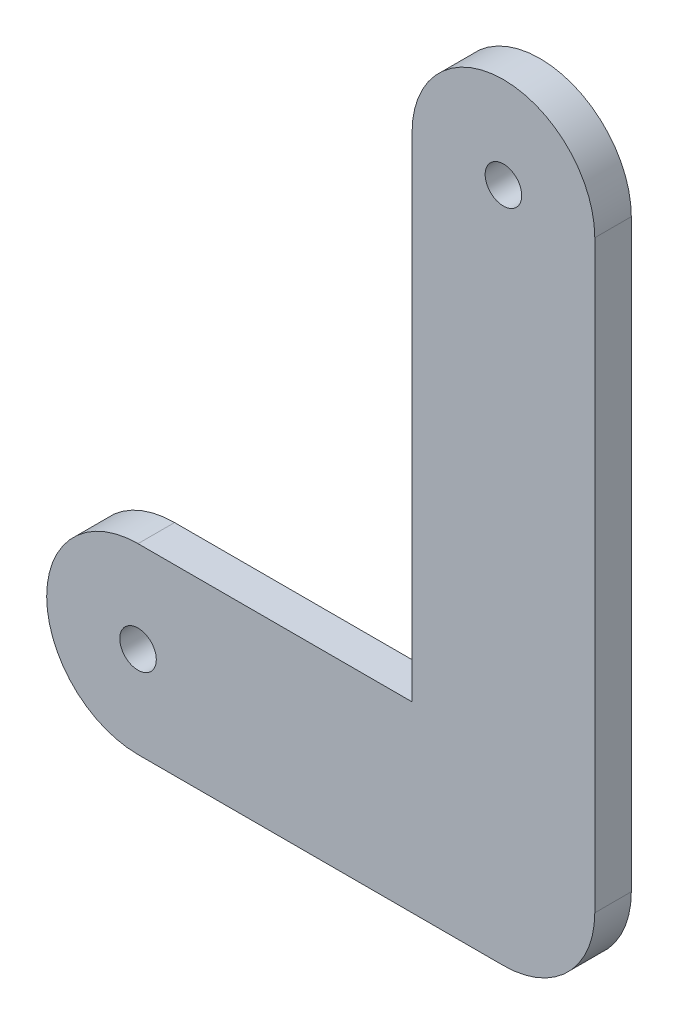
ISO-10303-21;
HEADER;
FILE_DESCRIPTION(('STEP AP214'),'2;1');
FILE_NAME('part.step','',(''),(''),'','','');
FILE_SCHEMA(('AUTOMOTIVE_DESIGN { 1 0 10303 214 1 1 1 1 }'));
ENDSEC;
DATA;
#1=APPLICATION_CONTEXT('core data for automotive mechanical design processes');
#2=APPLICATION_PROTOCOL_DEFINITION('international standard','automotive_design',2000,#1);
#3=PRODUCT_CONTEXT('',#1,'mechanical');
#4=PRODUCT('Part','Part','',(#3));
#5=PRODUCT_RELATED_PRODUCT_CATEGORY('part','',(#4));
#6=PRODUCT_DEFINITION_FORMATION('','',#4);
#7=PRODUCT_DEFINITION_CONTEXT('part definition',#1,'design');
#8=PRODUCT_DEFINITION('design','',#6,#7);
#9=PRODUCT_DEFINITION_SHAPE('','',#8);
#10=(LENGTH_UNIT() NAMED_UNIT(*) SI_UNIT(.MILLI.,.METRE.));
#11=(NAMED_UNIT(*) PLANE_ANGLE_UNIT() SI_UNIT($,.RADIAN.));
#12=(NAMED_UNIT(*) SI_UNIT($,.STERADIAN.) SOLID_ANGLE_UNIT());
#13=UNCERTAINTY_MEASURE_WITH_UNIT(LENGTH_MEASURE(1.E-05),#10,'distance_accuracy_value','');
#14=(GEOMETRIC_REPRESENTATION_CONTEXT(3) GLOBAL_UNCERTAINTY_ASSIGNED_CONTEXT((#13)) GLOBAL_UNIT_ASSIGNED_CONTEXT((#10,
#11,#12)) REPRESENTATION_CONTEXT('',''));
#15=CARTESIAN_POINT('',(0.,0.,0.));
#16=DIRECTION('',(0.,0.,1.));
#17=DIRECTION('',(1.,0.,0.));
#18=AXIS2_PLACEMENT_3D('',#15,#16,#17);
#19=CARTESIAN_POINT('',(0.,-25.,10.));
#20=DIRECTION('',(0.,-1.,0.));
#21=DIRECTION('',(1.,0.,0.));
#22=AXIS2_PLACEMENT_3D('',#19,#20,#21);
#23=PLANE('',#22);
#24=DIRECTION('',(-1.,0.,0.));
#25=VECTOR('',#24,1.);
#26=CARTESIAN_POINT('',(0.,-25.,0.));
#27=LINE('',#26,#25);
#28=CARTESIAN_POINT('',(0.,-25.,0.));
#29=VERTEX_POINT('',#28);
#30=CARTESIAN_POINT('',(-100.,-25.,0.));
#31=VERTEX_POINT('',#30);
#32=EDGE_CURVE('E120',#29,#31,#27,.T.);
#33=ORIENTED_EDGE('',*,*,#32,.F.);
#34=DIRECTION('',(0.,0.,-1.));
#35=VECTOR('',#34,1.);
#36=CARTESIAN_POINT('',(0.,-25.,10.));
#37=LINE('',#36,#35);
#38=CARTESIAN_POINT('',(0.,-25.,10.));
#39=VERTEX_POINT('',#38);
#40=EDGE_CURVE('E11',#39,#29,#37,.T.);
#41=ORIENTED_EDGE('',*,*,#40,.F.);
#42=DIRECTION('',(-1.,0.,0.));
#43=VECTOR('',#42,1.);
#44=CARTESIAN_POINT('',(0.,-25.,10.));
#45=LINE('',#44,#43);
#46=CARTESIAN_POINT('',(-100.,-25.,10.));
#47=VERTEX_POINT('',#46);
#48=EDGE_CURVE('E135',#39,#47,#45,.T.);
#49=ORIENTED_EDGE('',*,*,#48,.T.);
#50=DIRECTION('',(0.,0.,-1.));
#51=VECTOR('',#50,1.);
#52=CARTESIAN_POINT('',(-100.,-25.,10.));
#53=LINE('',#52,#51);
#54=EDGE_CURVE('E79',#47,#31,#53,.T.);
#55=ORIENTED_EDGE('',*,*,#54,.T.);
#56=EDGE_LOOP('',(#33,#41,#49,#55));
#57=FACE_BOUND('',#56,.T.);
#58=ADVANCED_FACE('F32',(#57),#23,.T.);
#59=CARTESIAN_POINT('',(0.,0.,10.));
#60=DIRECTION('',(0.,0.,-1.));
#61=DIRECTION('',(-1.,0.,0.));
#62=AXIS2_PLACEMENT_3D('',#59,#60,#61);
#63=CYLINDRICAL_SURFACE('',#62,25.);
#64=CARTESIAN_POINT('',(0.,0.,0.));
#65=DIRECTION('',(0.,0.,1.));
#66=DIRECTION('',(1.,0.,0.));
#67=AXIS2_PLACEMENT_3D('',#64,#65,#66);
#68=CIRCLE('',#67,25.);
#69=CARTESIAN_POINT('',(25.,0.,0.));
#70=VERTEX_POINT('',#69);
#71=EDGE_CURVE('E123',#29,#70,#68,.T.);
#72=ORIENTED_EDGE('',*,*,#71,.T.);
#73=DIRECTION('',(0.,0.,-1.));
#74=VECTOR('',#73,1.);
#75=CARTESIAN_POINT('',(25.,0.,10.));
#76=LINE('',#75,#74);
#77=CARTESIAN_POINT('',(25.,0.,10.));
#78=VERTEX_POINT('',#77);
#79=EDGE_CURVE('E40',#78,#70,#76,.T.);
#80=ORIENTED_EDGE('',*,*,#79,.F.);
#81=CARTESIAN_POINT('',(0.,0.,10.));
#82=DIRECTION('',(0.,0.,1.));
#83=DIRECTION('',(1.,0.,0.));
#84=AXIS2_PLACEMENT_3D('',#81,#82,#83);
#85=CIRCLE('',#84,25.);
#86=EDGE_CURVE('E171',#39,#78,#85,.T.);
#87=ORIENTED_EDGE('',*,*,#86,.F.);
#88=ORIENTED_EDGE('',*,*,#40,.T.);
#89=EDGE_LOOP('',(#72,#80,#87,#88));
#90=FACE_BOUND('',#89,.T.);
#91=ADVANCED_FACE('F162',(#90),#63,.T.);
#92=CARTESIAN_POINT('',(25.,0.,10.));
#93=DIRECTION('',(-1.,0.,0.));
#94=DIRECTION('',(0.,0.,1.));
#95=AXIS2_PLACEMENT_3D('',#92,#93,#94);
#96=PLANE('',#95);
#97=DIRECTION('',(0.,1.,0.));
#98=VECTOR('',#97,1.);
#99=CARTESIAN_POINT('',(25.,0.,0.));
#100=LINE('',#99,#98);
#101=CARTESIAN_POINT('',(25.,160.,0.));
#102=VERTEX_POINT('',#101);
#103=EDGE_CURVE('E126',#70,#102,#100,.T.);
#104=ORIENTED_EDGE('',*,*,#103,.T.);
#105=DIRECTION('',(0.,0.,-1.));
#106=VECTOR('',#105,1.);
#107=CARTESIAN_POINT('',(25.,160.,10.));
#108=LINE('',#107,#106);
#109=CARTESIAN_POINT('',(25.,160.,10.));
#110=VERTEX_POINT('',#109);
#111=EDGE_CURVE('E139',#110,#102,#108,.T.);
#112=ORIENTED_EDGE('',*,*,#111,.F.);
#113=DIRECTION('',(0.,1.,0.));
#114=VECTOR('',#113,1.);
#115=CARTESIAN_POINT('',(25.,0.,10.));
#116=LINE('',#115,#114);
#117=EDGE_CURVE('E115',#78,#110,#116,.T.);
#118=ORIENTED_EDGE('',*,*,#117,.F.);
#119=ORIENTED_EDGE('',*,*,#79,.T.);
#120=EDGE_LOOP('',(#104,#112,#118,#119));
#121=FACE_BOUND('',#120,.T.);
#122=ADVANCED_FACE('F146',(#121),#96,.F.);
#123=CARTESIAN_POINT('',(0.,160.,10.));
#124=DIRECTION('',(0.,0.,-1.));
#125=DIRECTION('',(-1.,0.,0.));
#126=AXIS2_PLACEMENT_3D('',#123,#124,#125);
#127=CYLINDRICAL_SURFACE('',#126,25.);
#128=CARTESIAN_POINT('',(0.,160.,0.));
#129=DIRECTION('',(0.,0.,1.));
#130=DIRECTION('',(1.,0.,0.));
#131=AXIS2_PLACEMENT_3D('',#128,#129,#130);
#132=CIRCLE('',#131,25.);
#133=CARTESIAN_POINT('',(-25.,160.,0.));
#134=VERTEX_POINT('',#133);
#135=EDGE_CURVE('E128',#102,#134,#132,.T.);
#136=ORIENTED_EDGE('',*,*,#135,.T.);
#137=DIRECTION('',(0.,0.,-1.));
#138=VECTOR('',#137,1.);
#139=CARTESIAN_POINT('',(-25.,160.,10.));
#140=LINE('',#139,#138);
#141=CARTESIAN_POINT('',(-25.,160.,10.));
#142=VERTEX_POINT('',#141);
#143=EDGE_CURVE('E104',#142,#134,#140,.T.);
#144=ORIENTED_EDGE('',*,*,#143,.F.);
#145=CARTESIAN_POINT('',(0.,160.,10.));
#146=DIRECTION('',(0.,0.,1.));
#147=DIRECTION('',(1.,0.,0.));
#148=AXIS2_PLACEMENT_3D('',#145,#146,#147);
#149=CIRCLE('',#148,25.);
#150=EDGE_CURVE('E112',#110,#142,#149,.T.);
#151=ORIENTED_EDGE('',*,*,#150,.F.);
#152=ORIENTED_EDGE('',*,*,#111,.T.);
#153=EDGE_LOOP('',(#136,#144,#151,#152));
#154=FACE_BOUND('',#153,.T.);
#155=ADVANCED_FACE('F154',(#154),#127,.T.);
#156=CARTESIAN_POINT('',(-25.,0.,10.));
#157=DIRECTION('',(-1.,0.,0.));
#158=DIRECTION('',(0.,0.,1.));
#159=AXIS2_PLACEMENT_3D('',#156,#157,#158);
#160=PLANE('',#159);
#161=DIRECTION('',(0.,1.,0.));
#162=VECTOR('',#161,1.);
#163=CARTESIAN_POINT('',(-25.,0.,0.));
#164=LINE('',#163,#162);
#165=CARTESIAN_POINT('',(-25.,25.,0.));
#166=VERTEX_POINT('',#165);
#167=EDGE_CURVE('E103',#166,#134,#164,.T.);
#168=ORIENTED_EDGE('',*,*,#167,.F.);
#169=DIRECTION('',(0.,0.,-1.));
#170=VECTOR('',#169,1.);
#171=CARTESIAN_POINT('',(-25.,25.,10.));
#172=LINE('',#171,#170);
#173=CARTESIAN_POINT('',(-25.,25.,10.));
#174=VERTEX_POINT('',#173);
#175=EDGE_CURVE('E97',#174,#166,#172,.T.);
#176=ORIENTED_EDGE('',*,*,#175,.F.);
#177=DIRECTION('',(0.,1.,0.));
#178=VECTOR('',#177,1.);
#179=CARTESIAN_POINT('',(-25.,0.,10.));
#180=LINE('',#179,#178);
#181=EDGE_CURVE('E101',#174,#142,#180,.T.);
#182=ORIENTED_EDGE('',*,*,#181,.T.);
#183=ORIENTED_EDGE('',*,*,#143,.T.);
#184=EDGE_LOOP('',(#168,#176,#182,#183));
#185=FACE_BOUND('',#184,.T.);
#186=ADVANCED_FACE('F99',(#185),#160,.T.);
#187=CARTESIAN_POINT('',(0.,25.,10.));
#188=DIRECTION('',(0.,-1.,0.));
#189=DIRECTION('',(1.,0.,0.));
#190=AXIS2_PLACEMENT_3D('',#187,#188,#189);
#191=PLANE('',#190);
#192=DIRECTION('',(-1.,0.,0.));
#193=VECTOR('',#192,1.);
#194=CARTESIAN_POINT('',(0.,25.,0.));
#195=LINE('',#194,#193);
#196=CARTESIAN_POINT('',(-100.,25.,0.));
#197=VERTEX_POINT('',#196);
#198=EDGE_CURVE('E72',#166,#197,#195,.T.);
#199=ORIENTED_EDGE('',*,*,#198,.T.);
#200=DIRECTION('',(0.,0.,-1.));
#201=VECTOR('',#200,1.);
#202=CARTESIAN_POINT('',(-100.,25.,10.));
#203=LINE('',#202,#201);
#204=CARTESIAN_POINT('',(-100.,25.,10.));
#205=VERTEX_POINT('',#204);
#206=EDGE_CURVE('E105',#205,#197,#203,.T.);
#207=ORIENTED_EDGE('',*,*,#206,.F.);
#208=DIRECTION('',(-1.,0.,0.));
#209=VECTOR('',#208,1.);
#210=CARTESIAN_POINT('',(0.,25.,10.));
#211=LINE('',#210,#209);
#212=EDGE_CURVE('E107',#174,#205,#211,.T.);
#213=ORIENTED_EDGE('',*,*,#212,.F.);
#214=ORIENTED_EDGE('',*,*,#175,.T.);
#215=EDGE_LOOP('',(#199,#207,#213,#214));
#216=FACE_BOUND('',#215,.T.);
#217=ADVANCED_FACE('F108',(#216),#191,.F.);
#218=CARTESIAN_POINT('',(-100.,0.,10.));
#219=DIRECTION('',(0.,0.,-1.));
#220=DIRECTION('',(-1.,0.,0.));
#221=AXIS2_PLACEMENT_3D('',#218,#219,#220);
#222=CYLINDRICAL_SURFACE('',#221,25.);
#223=CARTESIAN_POINT('',(-100.,0.,0.));
#224=DIRECTION('',(0.,0.,1.));
#225=DIRECTION('',(1.,0.,0.));
#226=AXIS2_PLACEMENT_3D('',#223,#224,#225);
#227=CIRCLE('',#226,25.);
#228=EDGE_CURVE('E133',#197,#31,#227,.T.);
#229=ORIENTED_EDGE('',*,*,#228,.T.);
#230=ORIENTED_EDGE('',*,*,#54,.F.);
#231=CARTESIAN_POINT('',(-100.,0.,10.));
#232=DIRECTION('',(0.,0.,1.));
#233=DIRECTION('',(1.,0.,0.));
#234=AXIS2_PLACEMENT_3D('',#231,#232,#233);
#235=CIRCLE('',#234,25.);
#236=EDGE_CURVE('E48',#205,#47,#235,.T.);
#237=ORIENTED_EDGE('',*,*,#236,.F.);
#238=ORIENTED_EDGE('',*,*,#206,.T.);
#239=EDGE_LOOP('',(#229,#230,#237,#238));
#240=FACE_BOUND('',#239,.T.);
#241=ADVANCED_FACE('F170',(#240),#222,.T.);
#242=CARTESIAN_POINT('',(0.,0.,10.));
#243=DIRECTION('',(0.,0.,1.));
#244=DIRECTION('',(1.,0.,0.));
#245=AXIS2_PLACEMENT_3D('',#242,#243,#244);
#246=PLANE('',#245);
#247=CARTESIAN_POINT('',(-100.,0.,10.));
#248=DIRECTION('',(0.,0.,1.));
#249=DIRECTION('',(1.,0.,0.));
#250=AXIS2_PLACEMENT_3D('',#247,#248,#249);
#251=CIRCLE('',#250,5.);
#252=CARTESIAN_POINT('',(-95.,0.,10.));
#253=VERTEX_POINT('',#252);
#254=EDGE_CURVE('E181',#253,#253,#251,.T.);
#255=ORIENTED_EDGE('',*,*,#254,.F.);
#256=EDGE_LOOP('',(#255));
#257=FACE_BOUND('',#256,.T.);
#258=CARTESIAN_POINT('',(0.,160.,10.));
#259=DIRECTION('',(0.,0.,1.));
#260=DIRECTION('',(1.,0.,0.));
#261=AXIS2_PLACEMENT_3D('',#258,#259,#260);
#262=CIRCLE('',#261,5.);
#263=CARTESIAN_POINT('',(5.,160.,10.));
#264=VERTEX_POINT('',#263);
#265=EDGE_CURVE('E175',#264,#264,#262,.T.);
#266=ORIENTED_EDGE('',*,*,#265,.F.);
#267=EDGE_LOOP('',(#266));
#268=FACE_BOUND('',#267,.T.);
#269=ORIENTED_EDGE('',*,*,#48,.F.);
#270=ORIENTED_EDGE('',*,*,#86,.T.);
#271=ORIENTED_EDGE('',*,*,#117,.T.);
#272=ORIENTED_EDGE('',*,*,#150,.T.);
#273=ORIENTED_EDGE('',*,*,#181,.F.);
#274=ORIENTED_EDGE('',*,*,#212,.T.);
#275=ORIENTED_EDGE('',*,*,#236,.T.);
#276=EDGE_LOOP('',(#269,#270,#271,#272,#273,#274,#275));
#277=FACE_BOUND('',#276,.T.);
#278=ADVANCED_FACE('F110',(#257,#268,#277),#246,.T.);
#279=CARTESIAN_POINT('',(0.,0.,0.));
#280=DIRECTION('',(0.,0.,1.));
#281=DIRECTION('',(1.,0.,0.));
#282=AXIS2_PLACEMENT_3D('',#279,#280,#281);
#283=PLANE('',#282);
#284=CARTESIAN_POINT('',(-100.,0.,0.));
#285=DIRECTION('',(0.,0.,1.));
#286=DIRECTION('',(1.,0.,0.));
#287=AXIS2_PLACEMENT_3D('',#284,#285,#286);
#288=CIRCLE('',#287,5.);
#289=CARTESIAN_POINT('',(-95.,0.,0.));
#290=VERTEX_POINT('',#289);
#291=EDGE_CURVE('E124',#290,#290,#288,.T.);
#292=ORIENTED_EDGE('',*,*,#291,.T.);
#293=EDGE_LOOP('',(#292));
#294=FACE_BOUND('',#293,.T.);
#295=CARTESIAN_POINT('',(0.,160.,0.));
#296=DIRECTION('',(0.,0.,1.));
#297=DIRECTION('',(1.,0.,0.));
#298=AXIS2_PLACEMENT_3D('',#295,#296,#297);
#299=CIRCLE('',#298,5.);
#300=CARTESIAN_POINT('',(5.,160.,0.));
#301=VERTEX_POINT('',#300);
#302=EDGE_CURVE('E178',#301,#301,#299,.T.);
#303=ORIENTED_EDGE('',*,*,#302,.T.);
#304=EDGE_LOOP('',(#303));
#305=FACE_BOUND('',#304,.T.);
#306=ORIENTED_EDGE('',*,*,#32,.T.);
#307=ORIENTED_EDGE('',*,*,#228,.F.);
#308=ORIENTED_EDGE('',*,*,#198,.F.);
#309=ORIENTED_EDGE('',*,*,#167,.T.);
#310=ORIENTED_EDGE('',*,*,#135,.F.);
#311=ORIENTED_EDGE('',*,*,#103,.F.);
#312=ORIENTED_EDGE('',*,*,#71,.F.);
#313=EDGE_LOOP('',(#306,#307,#308,#309,#310,#311,#312));
#314=FACE_BOUND('',#313,.T.);
#315=ADVANCED_FACE('F152',(#294,#305,#314),#283,.F.);
#316=CARTESIAN_POINT('',(0.,160.,0.));
#317=DIRECTION('',(0.,0.,1.));
#318=DIRECTION('',(1.,0.,0.));
#319=AXIS2_PLACEMENT_3D('',#316,#317,#318);
#320=CYLINDRICAL_SURFACE('',#319,5.);
#321=ORIENTED_EDGE('',*,*,#302,.F.);
#322=EDGE_LOOP('',(#321));
#323=FACE_BOUND('',#322,.T.);
#324=ORIENTED_EDGE('',*,*,#265,.T.);
#325=EDGE_LOOP('',(#324));
#326=FACE_BOUND('',#325,.T.);
#327=ADVANCED_FACE('F192',(#323,#326),#320,.F.);
#328=CARTESIAN_POINT('',(-100.,0.,0.));
#329=DIRECTION('',(0.,0.,1.));
#330=DIRECTION('',(1.,0.,0.));
#331=AXIS2_PLACEMENT_3D('',#328,#329,#330);
#332=CYLINDRICAL_SURFACE('',#331,5.);
#333=ORIENTED_EDGE('',*,*,#291,.F.);
#334=EDGE_LOOP('',(#333));
#335=FACE_BOUND('',#334,.T.);
#336=ORIENTED_EDGE('',*,*,#254,.T.);
#337=EDGE_LOOP('',(#336));
#338=FACE_BOUND('',#337,.T.);
#339=ADVANCED_FACE('F189',(#335,#338),#332,.F.);
#340=CLOSED_SHELL('',(#58,#91,#122,#155,#186,#217,#241,#278,#315,#327,#339));
#341=MANIFOLD_SOLID_BREP('B2',#340);
#342=ADVANCED_BREP_SHAPE_REPRESENTATION('',(#18,#341),#14);
#343=SHAPE_DEFINITION_REPRESENTATION(#9,#342);
ENDSEC;
END-ISO-10303-21;
